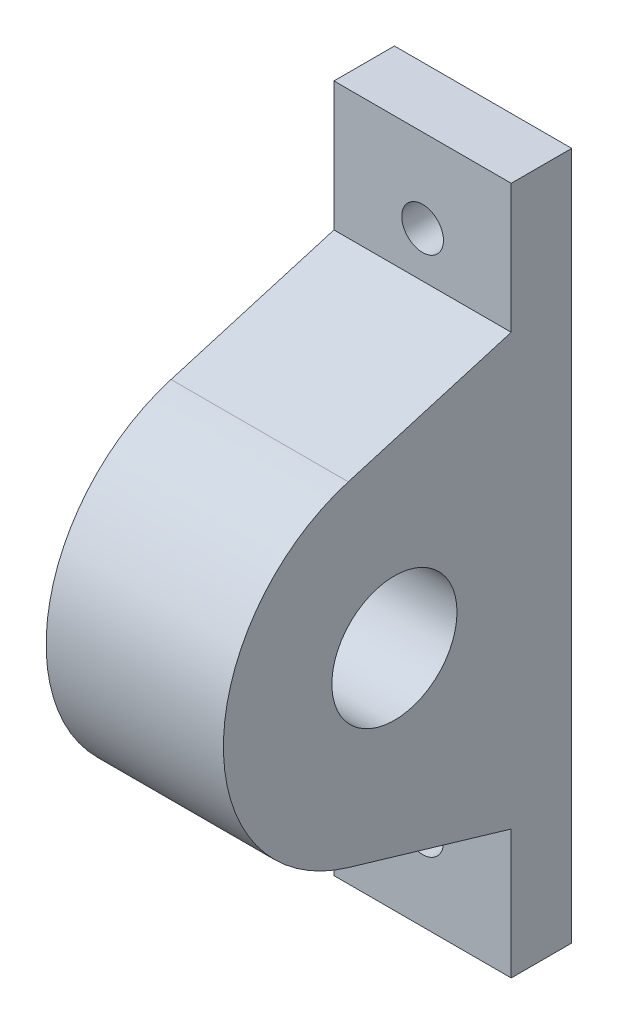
ISO-10303-21;
HEADER;
FILE_DESCRIPTION(('STEP AP214'),'2;1');
FILE_NAME('part.step','',(''),(''),'','','');
FILE_SCHEMA(('AUTOMOTIVE_DESIGN { 1 0 10303 214 1 1 1 1 }'));
ENDSEC;
DATA;
#1=APPLICATION_CONTEXT('core data for automotive mechanical design processes');
#2=APPLICATION_PROTOCOL_DEFINITION('international standard','automotive_design',2000,#1);
#3=PRODUCT_CONTEXT('',#1,'mechanical');
#4=PRODUCT('Part','Part','',(#3));
#5=PRODUCT_RELATED_PRODUCT_CATEGORY('part','',(#4));
#6=PRODUCT_DEFINITION_FORMATION('','',#4);
#7=PRODUCT_DEFINITION_CONTEXT('part definition',#1,'design');
#8=PRODUCT_DEFINITION('design','',#6,#7);
#9=PRODUCT_DEFINITION_SHAPE('','',#8);
#10=(LENGTH_UNIT() NAMED_UNIT(*) SI_UNIT(.MILLI.,.METRE.));
#11=(NAMED_UNIT(*) PLANE_ANGLE_UNIT() SI_UNIT($,.RADIAN.));
#12=(NAMED_UNIT(*) SI_UNIT($,.STERADIAN.) SOLID_ANGLE_UNIT());
#13=UNCERTAINTY_MEASURE_WITH_UNIT(LENGTH_MEASURE(1.E-05),#10,'distance_accuracy_value','');
#14=(GEOMETRIC_REPRESENTATION_CONTEXT(3) GLOBAL_UNCERTAINTY_ASSIGNED_CONTEXT((#13)) GLOBAL_UNIT_ASSIGNED_CONTEXT((#10,
#11,#12)) REPRESENTATION_CONTEXT('',''));
#15=CARTESIAN_POINT('',(0.,0.,0.));
#16=DIRECTION('',(0.,0.,1.));
#17=DIRECTION('',(1.,0.,0.));
#18=AXIS2_PLACEMENT_3D('',#15,#16,#17);
#19=CARTESIAN_POINT('',(85.,0.,0.));
#20=DIRECTION('',(1.,0.,0.));
#21=DIRECTION('',(0.,0.,-1.));
#22=AXIS2_PLACEMENT_3D('',#19,#20,#21);
#23=PLANE('',#22);
#24=DIRECTION('',(0.,0.,1.));
#25=VECTOR('',#24,1.);
#26=CARTESIAN_POINT('',(85.,165.,-83.5));
#27=LINE('',#26,#25);
#28=CARTESIAN_POINT('',(85.,165.,-83.5));
#29=VERTEX_POINT('',#28);
#30=CARTESIAN_POINT('',(85.,165.,-54.5));
#31=VERTEX_POINT('',#30);
#32=EDGE_CURVE('E174',#29,#31,#27,.T.);
#33=ORIENTED_EDGE('',*,*,#32,.T.);
#34=DIRECTION('',(0.,-1.,0.));
#35=VECTOR('',#34,1.);
#36=CARTESIAN_POINT('',(85.,165.,-54.5));
#37=LINE('',#36,#35);
#38=CARTESIAN_POINT('',(85.,103.12562301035,-54.5));
#39=VERTEX_POINT('',#38);
#40=EDGE_CURVE('E115',#31,#39,#37,.T.);
#41=ORIENTED_EDGE('',*,*,#40,.T.);
#42=DIRECTION('',(0.,-0.282839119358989,0.959167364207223));
#43=VECTOR('',#42,1.);
#44=CARTESIAN_POINT('',(85.,80.0904749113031,23.6170664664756));
#45=LINE('',#44,#43);
#46=CARTESIAN_POINT('',(85.,80.0904749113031,23.6170664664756));
#47=VERTEX_POINT('',#46);
#48=EDGE_CURVE('E214',#39,#47,#45,.T.);
#49=ORIENTED_EDGE('',*,*,#48,.T.);
#50=CARTESIAN_POINT('',(85.,0.,0.));
#51=DIRECTION('',(1.,0.,0.));
#52=DIRECTION('',(0.,0.,-1.));
#53=AXIS2_PLACEMENT_3D('',#50,#51,#52);
#54=CIRCLE('',#53,83.5);
#55=CARTESIAN_POINT('',(85.,-80.0904749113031,23.6170664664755));
#56=VERTEX_POINT('',#55);
#57=EDGE_CURVE('E217',#47,#56,#54,.T.);
#58=ORIENTED_EDGE('',*,*,#57,.T.);
#59=DIRECTION('',(0.,-0.282839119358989,-0.959167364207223));
#60=VECTOR('',#59,1.);
#61=CARTESIAN_POINT('',(85.,-80.0904749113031,23.6170664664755));
#62=LINE('',#61,#60);
#63=CARTESIAN_POINT('',(85.,-103.12562301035,-54.5));
#64=VERTEX_POINT('',#63);
#65=EDGE_CURVE('E135',#56,#64,#62,.T.);
#66=ORIENTED_EDGE('',*,*,#65,.T.);
#67=DIRECTION('',(0.,-1.,0.));
#68=VECTOR('',#67,1.);
#69=CARTESIAN_POINT('',(85.,-165.,-54.5));
#70=LINE('',#69,#68);
#71=CARTESIAN_POINT('',(85.,-165.,-54.5));
#72=VERTEX_POINT('',#71);
#73=EDGE_CURVE('E129',#64,#72,#70,.T.);
#74=ORIENTED_EDGE('',*,*,#73,.T.);
#75=DIRECTION('',(0.,0.,-1.));
#76=VECTOR('',#75,1.);
#77=CARTESIAN_POINT('',(85.,-165.,-83.4999999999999));
#78=LINE('',#77,#76);
#79=CARTESIAN_POINT('',(85.,-165.,-83.4999999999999));
#80=VERTEX_POINT('',#79);
#81=EDGE_CURVE('E133',#72,#80,#78,.T.);
#82=ORIENTED_EDGE('',*,*,#81,.T.);
#83=DIRECTION('',(0.,1.,0.));
#84=VECTOR('',#83,1.);
#85=CARTESIAN_POINT('',(85.,-165.,-83.4999999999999));
#86=LINE('',#85,#84);
#87=EDGE_CURVE('E67',#80,#29,#86,.T.);
#88=ORIENTED_EDGE('',*,*,#87,.T.);
#89=EDGE_LOOP('',(#33,#41,#49,#58,#66,#74,#82,#88));
#90=FACE_BOUND('',#89,.T.);
#91=CARTESIAN_POINT('',(85.,0.,1.5));
#92=DIRECTION('',(1.,0.,0.));
#93=DIRECTION('',(0.,0.,-1.));
#94=AXIS2_PLACEMENT_3D('',#91,#92,#93);
#95=CIRCLE('',#94,30.);
#96=CARTESIAN_POINT('',(85.,0.,-28.5));
#97=VERTEX_POINT('',#96);
#98=EDGE_CURVE('E159',#97,#97,#95,.T.);
#99=ORIENTED_EDGE('',*,*,#98,.F.);
#100=EDGE_LOOP('',(#99));
#101=FACE_BOUND('',#100,.T.);
#102=ADVANCED_FACE('F47',(#90,#101),#23,.T.);
#103=CARTESIAN_POINT('',(0.,0.,0.));
#104=DIRECTION('',(1.,0.,0.));
#105=DIRECTION('',(0.,0.,-1.));
#106=AXIS2_PLACEMENT_3D('',#103,#104,#105);
#107=PLANE('',#106);
#108=DIRECTION('',(0.,0.,1.));
#109=VECTOR('',#108,1.);
#110=CARTESIAN_POINT('',(0.,165.,-83.5));
#111=LINE('',#110,#109);
#112=CARTESIAN_POINT('',(0.,165.,-83.5));
#113=VERTEX_POINT('',#112);
#114=CARTESIAN_POINT('',(0.,165.,-54.5));
#115=VERTEX_POINT('',#114);
#116=EDGE_CURVE('E154',#113,#115,#111,.T.);
#117=ORIENTED_EDGE('',*,*,#116,.F.);
#118=DIRECTION('',(0.,1.,0.));
#119=VECTOR('',#118,1.);
#120=CARTESIAN_POINT('',(0.,-165.,-83.4999999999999));
#121=LINE('',#120,#119);
#122=CARTESIAN_POINT('',(0.,-165.,-83.4999999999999));
#123=VERTEX_POINT('',#122);
#124=EDGE_CURVE('E107',#123,#113,#121,.T.);
#125=ORIENTED_EDGE('',*,*,#124,.F.);
#126=DIRECTION('',(0.,0.,-1.));
#127=VECTOR('',#126,1.);
#128=CARTESIAN_POINT('',(0.,-165.,-83.4999999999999));
#129=LINE('',#128,#127);
#130=CARTESIAN_POINT('',(0.,-165.,-54.5));
#131=VERTEX_POINT('',#130);
#132=EDGE_CURVE('E99',#131,#123,#129,.T.);
#133=ORIENTED_EDGE('',*,*,#132,.F.);
#134=DIRECTION('',(0.,-1.,0.));
#135=VECTOR('',#134,1.);
#136=CARTESIAN_POINT('',(0.,-165.,-54.5));
#137=LINE('',#136,#135);
#138=CARTESIAN_POINT('',(0.,-103.12562301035,-54.5));
#139=VERTEX_POINT('',#138);
#140=EDGE_CURVE('E143',#139,#131,#137,.T.);
#141=ORIENTED_EDGE('',*,*,#140,.F.);
#142=DIRECTION('',(0.,-0.282839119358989,-0.959167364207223));
#143=VECTOR('',#142,1.);
#144=CARTESIAN_POINT('',(0.,-80.0904749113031,23.6170664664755));
#145=LINE('',#144,#143);
#146=CARTESIAN_POINT('',(0.,-80.0904749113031,23.6170664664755));
#147=VERTEX_POINT('',#146);
#148=EDGE_CURVE('E168',#147,#139,#145,.T.);
#149=ORIENTED_EDGE('',*,*,#148,.F.);
#150=CARTESIAN_POINT('',(0.,0.,0.));
#151=DIRECTION('',(1.,0.,0.));
#152=DIRECTION('',(0.,0.,-1.));
#153=AXIS2_PLACEMENT_3D('',#150,#151,#152);
#154=CIRCLE('',#153,83.5);
#155=CARTESIAN_POINT('',(0.,80.0904749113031,23.6170664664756));
#156=VERTEX_POINT('',#155);
#157=EDGE_CURVE('E165',#156,#147,#154,.T.);
#158=ORIENTED_EDGE('',*,*,#157,.F.);
#159=DIRECTION('',(0.,-0.282839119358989,0.959167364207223));
#160=VECTOR('',#159,1.);
#161=CARTESIAN_POINT('',(0.,80.0904749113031,23.6170664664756));
#162=LINE('',#161,#160);
#163=CARTESIAN_POINT('',(0.,103.12562301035,-54.5));
#164=VERTEX_POINT('',#163);
#165=EDGE_CURVE('E162',#164,#156,#162,.T.);
#166=ORIENTED_EDGE('',*,*,#165,.F.);
#167=DIRECTION('',(0.,-1.,0.));
#168=VECTOR('',#167,1.);
#169=CARTESIAN_POINT('',(0.,165.,-54.5));
#170=LINE('',#169,#168);
#171=EDGE_CURVE('E158',#115,#164,#170,.T.);
#172=ORIENTED_EDGE('',*,*,#171,.F.);
#173=EDGE_LOOP('',(#117,#125,#133,#141,#149,#158,#166,#172));
#174=FACE_BOUND('',#173,.T.);
#175=CARTESIAN_POINT('',(0.,0.,1.5));
#176=DIRECTION('',(1.,0.,0.));
#177=DIRECTION('',(0.,0.,-1.));
#178=AXIS2_PLACEMENT_3D('',#175,#176,#177);
#179=CIRCLE('',#178,30.);
#180=CARTESIAN_POINT('',(0.,0.,-28.5));
#181=VERTEX_POINT('',#180);
#182=EDGE_CURVE('E195',#181,#181,#179,.T.);
#183=ORIENTED_EDGE('',*,*,#182,.T.);
#184=EDGE_LOOP('',(#183));
#185=FACE_BOUND('',#184,.T.);
#186=ADVANCED_FACE('F231',(#174,#185),#107,.F.);
#187=CARTESIAN_POINT('',(85.,165.,-83.5));
#188=DIRECTION('',(0.,-1.,0.));
#189=DIRECTION('',(0.,0.,-1.));
#190=AXIS2_PLACEMENT_3D('',#187,#188,#189);
#191=PLANE('',#190);
#192=ORIENTED_EDGE('',*,*,#116,.T.);
#193=DIRECTION('',(-1.,0.,0.));
#194=VECTOR('',#193,1.);
#195=CARTESIAN_POINT('',(85.,165.,-54.5));
#196=LINE('',#195,#194);
#197=EDGE_CURVE('E11',#31,#115,#196,.T.);
#198=ORIENTED_EDGE('',*,*,#197,.F.);
#199=ORIENTED_EDGE('',*,*,#32,.F.);
#200=DIRECTION('',(-1.,0.,0.));
#201=VECTOR('',#200,1.);
#202=CARTESIAN_POINT('',(85.,165.,-83.5));
#203=LINE('',#202,#201);
#204=EDGE_CURVE('E150',#29,#113,#203,.T.);
#205=ORIENTED_EDGE('',*,*,#204,.T.);
#206=EDGE_LOOP('',(#192,#198,#199,#205));
#207=FACE_BOUND('',#206,.T.);
#208=ADVANCED_FACE('F49',(#207),#191,.F.);
#209=CARTESIAN_POINT('',(85.,165.,-54.5));
#210=DIRECTION('',(0.,0.,-1.));
#211=DIRECTION('',(0.,1.,0.));
#212=AXIS2_PLACEMENT_3D('',#209,#210,#211);
#213=PLANE('',#212);
#214=CARTESIAN_POINT('',(42.5,125.,-54.5));
#215=DIRECTION('',(0.,0.,1.));
#216=DIRECTION('',(1.,0.,0.));
#217=AXIS2_PLACEMENT_3D('',#214,#215,#216);
#218=CIRCLE('',#217,10.);
#219=CARTESIAN_POINT('',(52.5,125.,-54.5));
#220=VERTEX_POINT('',#219);
#221=EDGE_CURVE('E197',#220,#220,#218,.T.);
#222=ORIENTED_EDGE('',*,*,#221,.F.);
#223=EDGE_LOOP('',(#222));
#224=FACE_BOUND('',#223,.T.);
#225=ORIENTED_EDGE('',*,*,#171,.T.);
#226=DIRECTION('',(-1.,0.,0.));
#227=VECTOR('',#226,1.);
#228=CARTESIAN_POINT('',(85.,103.12562301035,-54.5));
#229=LINE('',#228,#227);
#230=EDGE_CURVE('E58',#39,#164,#229,.T.);
#231=ORIENTED_EDGE('',*,*,#230,.F.);
#232=ORIENTED_EDGE('',*,*,#40,.F.);
#233=ORIENTED_EDGE('',*,*,#197,.T.);
#234=EDGE_LOOP('',(#225,#231,#232,#233));
#235=FACE_BOUND('',#234,.T.);
#236=ADVANCED_FACE('F292',(#224,#235),#213,.F.);
#237=CARTESIAN_POINT('',(85.,80.0904749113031,23.6170664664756));
#238=DIRECTION('',(0.,-0.959167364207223,-0.282839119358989));
#239=DIRECTION('',(0.,0.282839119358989,-0.959167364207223));
#240=AXIS2_PLACEMENT_3D('',#237,#238,#239);
#241=PLANE('',#240);
#242=ORIENTED_EDGE('',*,*,#165,.T.);
#243=DIRECTION('',(-1.,0.,0.));
#244=VECTOR('',#243,1.);
#245=CARTESIAN_POINT('',(85.,80.0904749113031,23.6170664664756));
#246=LINE('',#245,#244);
#247=EDGE_CURVE('E182',#47,#156,#246,.T.);
#248=ORIENTED_EDGE('',*,*,#247,.F.);
#249=ORIENTED_EDGE('',*,*,#48,.F.);
#250=ORIENTED_EDGE('',*,*,#230,.T.);
#251=EDGE_LOOP('',(#242,#248,#249,#250));
#252=FACE_BOUND('',#251,.T.);
#253=ADVANCED_FACE('F295',(#252),#241,.F.);
#254=CARTESIAN_POINT('',(85.,0.,0.));
#255=DIRECTION('',(-1.,0.,0.));
#256=DIRECTION('',(0.,0.,1.));
#257=AXIS2_PLACEMENT_3D('',#254,#255,#256);
#258=CYLINDRICAL_SURFACE('',#257,83.5);
#259=ORIENTED_EDGE('',*,*,#157,.T.);
#260=DIRECTION('',(-1.,0.,0.));
#261=VECTOR('',#260,1.);
#262=CARTESIAN_POINT('',(85.,-80.0904749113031,23.6170664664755));
#263=LINE('',#262,#261);
#264=EDGE_CURVE('E179',#56,#147,#263,.T.);
#265=ORIENTED_EDGE('',*,*,#264,.F.);
#266=ORIENTED_EDGE('',*,*,#57,.F.);
#267=ORIENTED_EDGE('',*,*,#247,.T.);
#268=EDGE_LOOP('',(#259,#265,#266,#267));
#269=FACE_BOUND('',#268,.T.);
#270=ADVANCED_FACE('F224',(#269),#258,.T.);
#271=CARTESIAN_POINT('',(85.,-80.0904749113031,23.6170664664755));
#272=DIRECTION('',(0.,0.959167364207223,-0.282839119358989));
#273=DIRECTION('',(0.,0.282839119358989,0.959167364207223));
#274=AXIS2_PLACEMENT_3D('',#271,#272,#273);
#275=PLANE('',#274);
#276=ORIENTED_EDGE('',*,*,#148,.T.);
#277=DIRECTION('',(-1.,0.,0.));
#278=VECTOR('',#277,1.);
#279=CARTESIAN_POINT('',(85.,-103.12562301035,-54.5));
#280=LINE('',#279,#278);
#281=EDGE_CURVE('E144',#64,#139,#280,.T.);
#282=ORIENTED_EDGE('',*,*,#281,.F.);
#283=ORIENTED_EDGE('',*,*,#65,.F.);
#284=ORIENTED_EDGE('',*,*,#264,.T.);
#285=EDGE_LOOP('',(#276,#282,#283,#284));
#286=FACE_BOUND('',#285,.T.);
#287=ADVANCED_FACE('F228',(#286),#275,.F.);
#288=CARTESIAN_POINT('',(85.,-165.,-54.5));
#289=DIRECTION('',(0.,0.,-1.));
#290=DIRECTION('',(0.,1.,0.));
#291=AXIS2_PLACEMENT_3D('',#288,#289,#290);
#292=PLANE('',#291);
#293=CARTESIAN_POINT('',(42.5000000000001,-125.,-54.5));
#294=DIRECTION('',(0.,0.,1.));
#295=DIRECTION('',(-1.,0.,0.));
#296=AXIS2_PLACEMENT_3D('',#293,#294,#295);
#297=CIRCLE('',#296,10.);
#298=CARTESIAN_POINT('',(32.5000000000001,-125.,-54.5));
#299=VERTEX_POINT('',#298);
#300=EDGE_CURVE('E191',#299,#299,#297,.T.);
#301=ORIENTED_EDGE('',*,*,#300,.F.);
#302=EDGE_LOOP('',(#301));
#303=FACE_BOUND('',#302,.T.);
#304=ORIENTED_EDGE('',*,*,#140,.T.);
#305=DIRECTION('',(-1.,0.,0.));
#306=VECTOR('',#305,1.);
#307=CARTESIAN_POINT('',(85.,-165.,-54.5));
#308=LINE('',#307,#306);
#309=EDGE_CURVE('E140',#72,#131,#308,.T.);
#310=ORIENTED_EDGE('',*,*,#309,.F.);
#311=ORIENTED_EDGE('',*,*,#73,.F.);
#312=ORIENTED_EDGE('',*,*,#281,.T.);
#313=EDGE_LOOP('',(#304,#310,#311,#312));
#314=FACE_BOUND('',#313,.T.);
#315=ADVANCED_FACE('F141',(#303,#314),#292,.F.);
#316=CARTESIAN_POINT('',(85.,-165.,-83.4999999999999));
#317=DIRECTION('',(0.,1.,0.));
#318=DIRECTION('',(0.,0.,1.));
#319=AXIS2_PLACEMENT_3D('',#316,#317,#318);
#320=PLANE('',#319);
#321=ORIENTED_EDGE('',*,*,#132,.T.);
#322=DIRECTION('',(-1.,0.,0.));
#323=VECTOR('',#322,1.);
#324=CARTESIAN_POINT('',(85.,-165.,-83.4999999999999));
#325=LINE('',#324,#323);
#326=EDGE_CURVE('E145',#80,#123,#325,.T.);
#327=ORIENTED_EDGE('',*,*,#326,.F.);
#328=ORIENTED_EDGE('',*,*,#81,.F.);
#329=ORIENTED_EDGE('',*,*,#309,.T.);
#330=EDGE_LOOP('',(#321,#327,#328,#329));
#331=FACE_BOUND('',#330,.T.);
#332=ADVANCED_FACE('F147',(#331),#320,.F.);
#333=CARTESIAN_POINT('',(85.,-165.,-83.4999999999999));
#334=DIRECTION('',(0.,0.,1.));
#335=DIRECTION('',(0.,-1.,0.));
#336=AXIS2_PLACEMENT_3D('',#333,#334,#335);
#337=PLANE('',#336);
#338=CARTESIAN_POINT('',(42.5000000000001,-125.,-83.5));
#339=DIRECTION('',(0.,0.,1.));
#340=DIRECTION('',(0.,-1.,0.));
#341=AXIS2_PLACEMENT_3D('',#338,#339,#340);
#342=CIRCLE('',#341,10.);
#343=CARTESIAN_POINT('',(42.5000000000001,-135.,-83.5));
#344=VERTEX_POINT('',#343);
#345=EDGE_CURVE('E51',#344,#344,#342,.T.);
#346=ORIENTED_EDGE('',*,*,#345,.T.);
#347=EDGE_LOOP('',(#346));
#348=FACE_BOUND('',#347,.T.);
#349=CARTESIAN_POINT('',(42.5,125.,-83.5));
#350=DIRECTION('',(0.,0.,1.));
#351=DIRECTION('',(0.,-1.,0.));
#352=AXIS2_PLACEMENT_3D('',#349,#350,#351);
#353=CIRCLE('',#352,10.);
#354=CARTESIAN_POINT('',(42.5,115.,-83.5));
#355=VERTEX_POINT('',#354);
#356=EDGE_CURVE('E188',#355,#355,#353,.T.);
#357=ORIENTED_EDGE('',*,*,#356,.T.);
#358=EDGE_LOOP('',(#357));
#359=FACE_BOUND('',#358,.T.);
#360=ORIENTED_EDGE('',*,*,#124,.T.);
#361=ORIENTED_EDGE('',*,*,#204,.F.);
#362=ORIENTED_EDGE('',*,*,#87,.F.);
#363=ORIENTED_EDGE('',*,*,#326,.T.);
#364=EDGE_LOOP('',(#360,#361,#362,#363));
#365=FACE_BOUND('',#364,.T.);
#366=ADVANCED_FACE('F237',(#348,#359,#365),#337,.F.);
#367=CARTESIAN_POINT('',(85.,0.,1.5));
#368=DIRECTION('',(-1.,0.,0.));
#369=DIRECTION('',(0.,0.,1.));
#370=AXIS2_PLACEMENT_3D('',#367,#368,#369);
#371=CYLINDRICAL_SURFACE('',#370,30.);
#372=ORIENTED_EDGE('',*,*,#98,.T.);
#373=EDGE_LOOP('',(#372));
#374=FACE_BOUND('',#373,.T.);
#375=ORIENTED_EDGE('',*,*,#182,.F.);
#376=EDGE_LOOP('',(#375));
#377=FACE_BOUND('',#376,.T.);
#378=ADVANCED_FACE('F239',(#374,#377),#371,.F.);
#379=CARTESIAN_POINT('',(42.5,125.,-139.5));
#380=DIRECTION('',(0.,0.,1.));
#381=DIRECTION('',(1.,0.,0.));
#382=AXIS2_PLACEMENT_3D('',#379,#380,#381);
#383=CYLINDRICAL_SURFACE('',#382,10.);
#384=ORIENTED_EDGE('',*,*,#221,.T.);
#385=EDGE_LOOP('',(#384));
#386=FACE_BOUND('',#385,.T.);
#387=ORIENTED_EDGE('',*,*,#356,.F.);
#388=EDGE_LOOP('',(#387));
#389=FACE_BOUND('',#388,.T.);
#390=ADVANCED_FACE('F246',(#386,#389),#383,.F.);
#391=CARTESIAN_POINT('',(42.5000000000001,-125.,-139.5));
#392=DIRECTION('',(0.,0.,1.));
#393=DIRECTION('',(1.,0.,0.));
#394=AXIS2_PLACEMENT_3D('',#391,#392,#393);
#395=CYLINDRICAL_SURFACE('',#394,10.);
#396=ORIENTED_EDGE('',*,*,#300,.T.);
#397=EDGE_LOOP('',(#396));
#398=FACE_BOUND('',#397,.T.);
#399=ORIENTED_EDGE('',*,*,#345,.F.);
#400=EDGE_LOOP('',(#399));
#401=FACE_BOUND('',#400,.T.);
#402=ADVANCED_FACE('F260',(#398,#401),#395,.F.);
#403=CLOSED_SHELL('',(#102,#186,#208,#236,#253,#270,#287,#315,#332,#366,#378,#390,#402));
#404=MANIFOLD_SOLID_BREP('B2',#403);
#405=ADVANCED_BREP_SHAPE_REPRESENTATION('',(#18,#404),#14);
#406=SHAPE_DEFINITION_REPRESENTATION(#9,#405);
ENDSEC;
END-ISO-10303-21;
